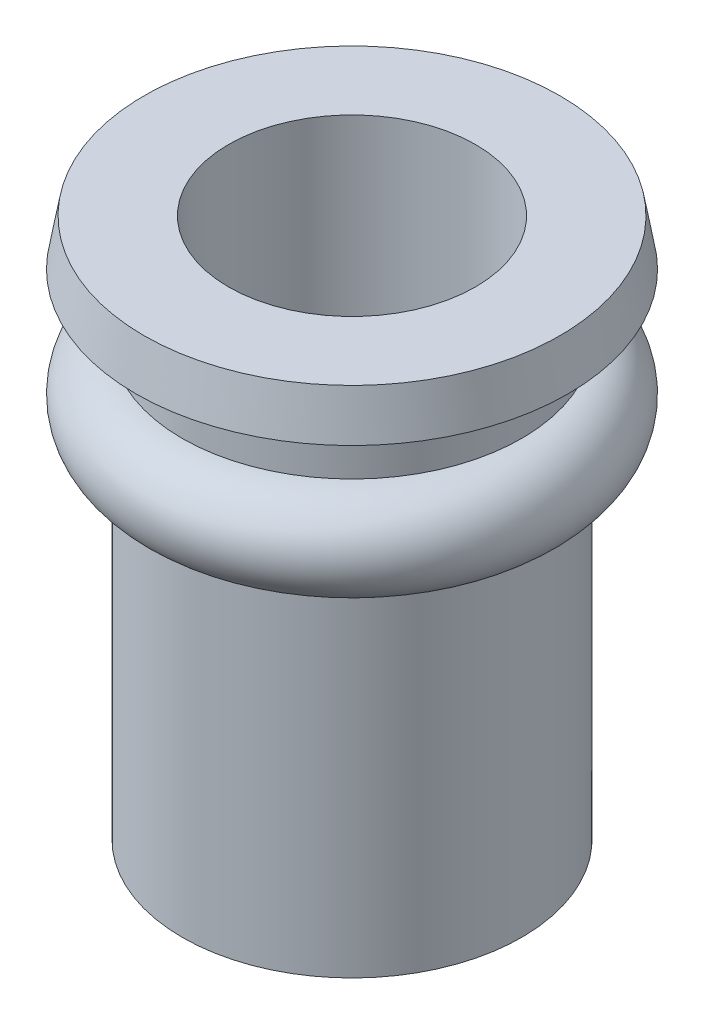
ISO-10303-21;
HEADER;
FILE_DESCRIPTION(('STEP AP214'),'2;1');
FILE_NAME('part.step','',(''),(''),'','','');
FILE_SCHEMA(('AUTOMOTIVE_DESIGN { 1 0 10303 214 1 1 1 1 }'));
ENDSEC;
DATA;
#1=APPLICATION_CONTEXT('core data for automotive mechanical design processes');
#2=APPLICATION_PROTOCOL_DEFINITION('international standard','automotive_design',2000,#1);
#3=PRODUCT_CONTEXT('',#1,'mechanical');
#4=PRODUCT('Part','Part','',(#3));
#5=PRODUCT_RELATED_PRODUCT_CATEGORY('part','',(#4));
#6=PRODUCT_DEFINITION_FORMATION('','',#4);
#7=PRODUCT_DEFINITION_CONTEXT('part definition',#1,'design');
#8=PRODUCT_DEFINITION('design','',#6,#7);
#9=PRODUCT_DEFINITION_SHAPE('','',#8);
#10=(LENGTH_UNIT() NAMED_UNIT(*) SI_UNIT(.MILLI.,.METRE.));
#11=(NAMED_UNIT(*) PLANE_ANGLE_UNIT() SI_UNIT($,.RADIAN.));
#12=(NAMED_UNIT(*) SI_UNIT($,.STERADIAN.) SOLID_ANGLE_UNIT());
#13=UNCERTAINTY_MEASURE_WITH_UNIT(LENGTH_MEASURE(1.E-05),#10,'distance_accuracy_value','');
#14=(GEOMETRIC_REPRESENTATION_CONTEXT(3) GLOBAL_UNCERTAINTY_ASSIGNED_CONTEXT((#13)) GLOBAL_UNIT_ASSIGNED_CONTEXT((#10,
#11,#12)) REPRESENTATION_CONTEXT('',''));
#15=CARTESIAN_POINT('',(0.,0.,0.));
#16=DIRECTION('',(0.,0.,1.));
#17=DIRECTION('',(1.,0.,0.));
#18=AXIS2_PLACEMENT_3D('',#15,#16,#17);
#19=CARTESIAN_POINT('',(6.7355095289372,17.4999999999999,-4.44089209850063E-13));
#20=DIRECTION('',(0.,-1.,0.));
#21=DIRECTION('',(0.,0.,-0.999999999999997));
#22=AXIS2_PLACEMENT_3D('',#19,#20,#21);
#23=PLANE('',#22);
#24=CARTESIAN_POINT('',(-5.55111512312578E-13,17.5,3.33066907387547E-13));
#25=DIRECTION('',(0.,-1.,0.));
#26=DIRECTION('',(0.,0.,-0.999999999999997));
#27=AXIS2_PLACEMENT_3D('',#24,#25,#26);
#28=CIRCLE('',#27,4.);
#29=CARTESIAN_POINT('',(-5.76487100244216E-13,17.5,-3.99999999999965));
#30=VERTEX_POINT('',#29);
#31=EDGE_CURVE('E54',#30,#30,#28,.T.);
#32=ORIENTED_EDGE('',*,*,#31,.T.);
#33=EDGE_LOOP('',(#32));
#34=FACE_BOUND('',#33,.T.);
#35=CARTESIAN_POINT('',(-5.55111512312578E-13,17.5,3.33066907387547E-13));
#36=DIRECTION('',(0.,1.,0.));
#37=DIRECTION('',(0.,0.,0.999999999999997));
#38=AXIS2_PLACEMENT_3D('',#35,#36,#37);
#39=CIRCLE('',#38,6.73550952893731);
#40=CARTESIAN_POINT('',(-5.19117643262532E-13,17.5,6.73550952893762));
#41=VERTEX_POINT('',#40);
#42=EDGE_CURVE('E10',#41,#41,#39,.T.);
#43=ORIENTED_EDGE('',*,*,#42,.T.);
#44=EDGE_LOOP('',(#43));
#45=FACE_BOUND('',#44,.T.);
#46=ADVANCED_FACE('F29',(#34,#45),#23,.F.);
#47=CARTESIAN_POINT('',(0.,16.,-5.55111512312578E-13));
#48=DIRECTION('',(0.,-1.,0.));
#49=DIRECTION('',(0.,0.,-0.999999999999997));
#50=AXIS2_PLACEMENT_3D('',#47,#48,#49);
#51=CONICAL_SURFACE('',#50,7.,0.174532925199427);
#52=ORIENTED_EDGE('',*,*,#42,.F.);
#53=EDGE_LOOP('',(#52));
#54=FACE_BOUND('',#53,.T.);
#55=CARTESIAN_POINT('',(0.,16.,-5.55111512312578E-13));
#56=DIRECTION('',(0.,1.,0.));
#57=DIRECTION('',(0.,0.,0.999999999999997));
#58=AXIS2_PLACEMENT_3D('',#55,#56,#57);
#59=CIRCLE('',#58,7.);
#60=CARTESIAN_POINT('',(0.,16.,6.99999999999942));
#61=VERTEX_POINT('',#60);
#62=EDGE_CURVE('E35',#61,#61,#59,.T.);
#63=ORIENTED_EDGE('',*,*,#62,.T.);
#64=EDGE_LOOP('',(#63));
#65=FACE_BOUND('',#64,.T.);
#66=ADVANCED_FACE('F82',(#54,#65),#51,.T.);
#67=CARTESIAN_POINT('',(5.50000000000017,15.9999999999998,-1.22124532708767E-12));
#68=DIRECTION('',(0.,1.,0.));
#69=DIRECTION('',(0.,0.,0.999999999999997));
#70=AXIS2_PLACEMENT_3D('',#67,#68,#69);
#71=PLANE('',#70);
#72=ORIENTED_EDGE('',*,*,#62,.F.);
#73=EDGE_LOOP('',(#72));
#74=FACE_BOUND('',#73,.T.);
#75=CARTESIAN_POINT('',(0.,16.,-5.55111512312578E-13));
#76=DIRECTION('',(0.,1.,0.));
#77=DIRECTION('',(0.,0.,0.999999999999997));
#78=AXIS2_PLACEMENT_3D('',#75,#76,#77);
#79=CIRCLE('',#78,5.5);
#80=CARTESIAN_POINT('',(0.,16.,5.49999999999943));
#81=VERTEX_POINT('',#80);
#82=EDGE_CURVE('E39',#81,#81,#79,.T.);
#83=ORIENTED_EDGE('',*,*,#82,.T.);
#84=EDGE_LOOP('',(#83));
#85=FACE_BOUND('',#84,.T.);
#86=ADVANCED_FACE('F87',(#74,#85),#71,.F.);
#87=CARTESIAN_POINT('',(-9.99200722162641E-13,38.9534603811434,-8.88178419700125E-13));
#88=DIRECTION('',(0.,1.,0.));
#89=DIRECTION('',(0.,0.,0.999999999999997));
#90=AXIS2_PLACEMENT_3D('',#87,#88,#89);
#91=CYLINDRICAL_SURFACE('',#90,5.5);
#92=ORIENTED_EDGE('',*,*,#82,.F.);
#93=EDGE_LOOP('',(#92));
#94=FACE_BOUND('',#93,.T.);
#95=CARTESIAN_POINT('',(-3.33066907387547E-13,14.,-1.11022302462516E-13));
#96=DIRECTION('',(0.,1.,0.));
#97=DIRECTION('',(0.,0.,0.999999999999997));
#98=AXIS2_PLACEMENT_3D('',#95,#96,#97);
#99=CIRCLE('',#98,5.5);
#100=CARTESIAN_POINT('',(-3.03675473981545E-13,14.,5.49999999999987));
#101=VERTEX_POINT('',#100);
#102=EDGE_CURVE('E43',#101,#101,#99,.T.);
#103=ORIENTED_EDGE('',*,*,#102,.T.);
#104=EDGE_LOOP('',(#103));
#105=FACE_BOUND('',#104,.T.);
#106=ADVANCED_FACE('F77',(#94,#105),#91,.T.);
#107=CARTESIAN_POINT('',(0.,12.5,-8.88178419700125E-13));
#108=DIRECTION('',(0.,1.,0.));
#109=DIRECTION('',(0.,0.,0.999999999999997));
#110=AXIS2_PLACEMENT_3D('',#107,#108,#109);
#111=TOROIDAL_SURFACE('',#110,5.5,1.5);
#112=ORIENTED_EDGE('',*,*,#102,.F.);
#113=EDGE_LOOP('',(#112));
#114=FACE_BOUND('',#113,.T.);
#115=CARTESIAN_POINT('',(4.44089209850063E-13,11.,-1.22124532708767E-12));
#116=DIRECTION('',(0.,1.,0.));
#117=DIRECTION('',(0.,0.,0.999999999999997));
#118=AXIS2_PLACEMENT_3D('',#115,#116,#117);
#119=CIRCLE('',#118,5.5);
#120=CARTESIAN_POINT('',(4.73480643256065E-13,11.,5.49999999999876));
#121=VERTEX_POINT('',#120);
#122=EDGE_CURVE('E48',#121,#121,#119,.T.);
#123=ORIENTED_EDGE('',*,*,#122,.T.);
#124=EDGE_LOOP('',(#123));
#125=FACE_BOUND('',#124,.T.);
#126=ADVANCED_FACE('F71',(#114,#125),#111,.T.);
#127=CARTESIAN_POINT('',(-9.99200722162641E-13,38.9534603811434,-8.88178419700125E-13));
#128=DIRECTION('',(0.,1.,0.));
#129=DIRECTION('',(0.,0.,0.999999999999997));
#130=AXIS2_PLACEMENT_3D('',#127,#128,#129);
#131=CYLINDRICAL_SURFACE('',#130,5.5);
#132=ORIENTED_EDGE('',*,*,#122,.F.);
#133=EDGE_LOOP('',(#132));
#134=FACE_BOUND('',#133,.T.);
#135=CARTESIAN_POINT('',(0.,0.,0.));
#136=DIRECTION('',(0.,1.,0.));
#137=DIRECTION('',(0.,0.,0.999999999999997));
#138=AXIS2_PLACEMENT_3D('',#135,#136,#137);
#139=CIRCLE('',#138,5.5);
#140=CARTESIAN_POINT('',(0.,0.,5.49999999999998));
#141=VERTEX_POINT('',#140);
#142=EDGE_CURVE('E51',#141,#141,#139,.T.);
#143=ORIENTED_EDGE('',*,*,#142,.T.);
#144=EDGE_LOOP('',(#143));
#145=FACE_BOUND('',#144,.T.);
#146=ADVANCED_FACE('F66',(#134,#145),#131,.T.);
#147=CARTESIAN_POINT('',(5.50000000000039,0.,-1.11022302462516E-13));
#148=DIRECTION('',(0.,1.,0.));
#149=DIRECTION('',(0.,0.,0.999999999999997));
#150=AXIS2_PLACEMENT_3D('',#147,#148,#149);
#151=PLANE('',#150);
#152=CARTESIAN_POINT('',(0.,0.,0.));
#153=DIRECTION('',(0.,-1.,0.));
#154=DIRECTION('',(0.,0.,-0.999999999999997));
#155=AXIS2_PLACEMENT_3D('',#152,#153,#154);
#156=CIRCLE('',#155,4.);
#157=CARTESIAN_POINT('',(0.,0.,-3.99999999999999));
#158=VERTEX_POINT('',#157);
#159=EDGE_CURVE('E57',#158,#158,#156,.T.);
#160=ORIENTED_EDGE('',*,*,#159,.F.);
#161=EDGE_LOOP('',(#160));
#162=FACE_BOUND('',#161,.T.);
#163=ORIENTED_EDGE('',*,*,#142,.F.);
#164=EDGE_LOOP('',(#163));
#165=FACE_BOUND('',#164,.T.);
#166=ADVANCED_FACE('F63',(#162,#165),#151,.F.);
#167=CARTESIAN_POINT('',(-5.55111512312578E-13,17.5,3.33066907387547E-13));
#168=DIRECTION('',(0.,-1.,0.));
#169=DIRECTION('',(0.,0.,-0.999999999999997));
#170=AXIS2_PLACEMENT_3D('',#167,#168,#169);
#171=CYLINDRICAL_SURFACE('',#170,4.);
#172=ORIENTED_EDGE('',*,*,#31,.F.);
#173=EDGE_LOOP('',(#172));
#174=FACE_BOUND('',#173,.T.);
#175=ORIENTED_EDGE('',*,*,#159,.T.);
#176=EDGE_LOOP('',(#175));
#177=FACE_BOUND('',#176,.T.);
#178=ADVANCED_FACE('F61',(#174,#177),#171,.F.);
#179=CLOSED_SHELL('',(#46,#66,#86,#106,#126,#146,#166,#178));
#180=MANIFOLD_SOLID_BREP('B2',#179);
#181=ADVANCED_BREP_SHAPE_REPRESENTATION('',(#18,#180),#14);
#182=SHAPE_DEFINITION_REPRESENTATION(#9,#181);
ENDSEC;
END-ISO-10303-21;
